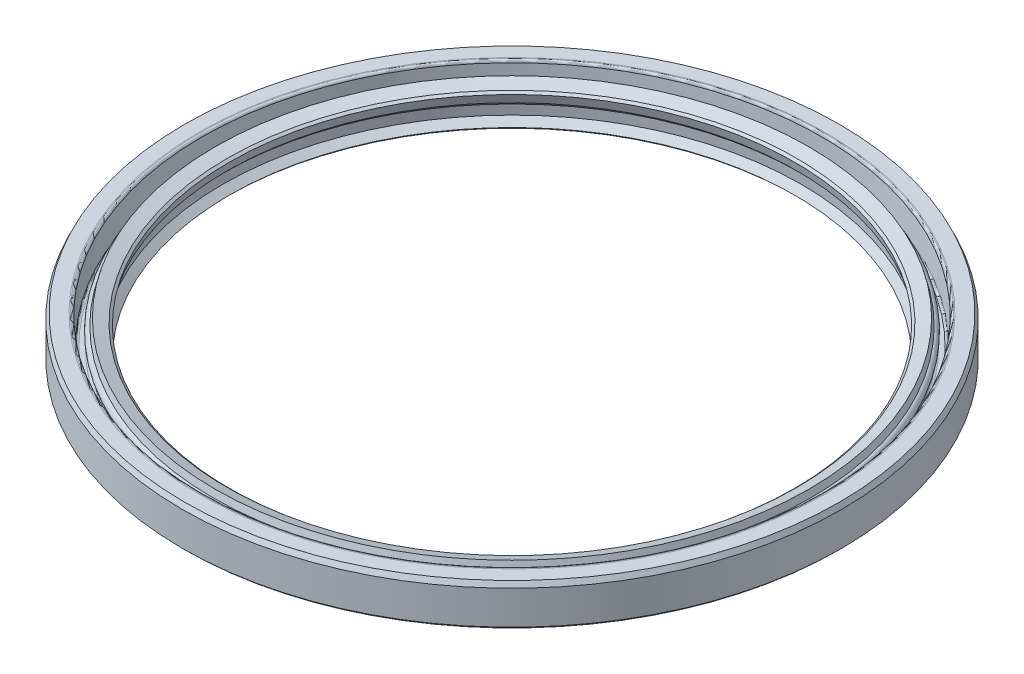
ISO-10303-21;
HEADER;
FILE_DESCRIPTION(('STEP AP214'),'2;1');
FILE_NAME('part.step','',(''),(''),'','','');
FILE_SCHEMA(('AUTOMOTIVE_DESIGN { 1 0 10303 214 1 1 1 1 }'));
ENDSEC;
DATA;
#1=APPLICATION_CONTEXT('core data for automotive mechanical design processes');
#2=APPLICATION_PROTOCOL_DEFINITION('international standard','automotive_design',2000,#1);
#3=PRODUCT_CONTEXT('',#1,'mechanical');
#4=PRODUCT('Part','Part','',(#3));
#5=PRODUCT_RELATED_PRODUCT_CATEGORY('part','',(#4));
#6=PRODUCT_DEFINITION_FORMATION('','',#4);
#7=PRODUCT_DEFINITION_CONTEXT('part definition',#1,'design');
#8=PRODUCT_DEFINITION('design','',#6,#7);
#9=PRODUCT_DEFINITION_SHAPE('','',#8);
#10=(LENGTH_UNIT() NAMED_UNIT(*) SI_UNIT(.MILLI.,.METRE.));
#11=(NAMED_UNIT(*) PLANE_ANGLE_UNIT() SI_UNIT($,.RADIAN.));
#12=(NAMED_UNIT(*) SI_UNIT($,.STERADIAN.) SOLID_ANGLE_UNIT());
#13=UNCERTAINTY_MEASURE_WITH_UNIT(LENGTH_MEASURE(1.E-05),#10,'distance_accuracy_value','');
#14=(GEOMETRIC_REPRESENTATION_CONTEXT(3) GLOBAL_UNCERTAINTY_ASSIGNED_CONTEXT((#13)) GLOBAL_UNIT_ASSIGNED_CONTEXT((#10,
#11,#12)) REPRESENTATION_CONTEXT('',''));
#15=CARTESIAN_POINT('',(0.,0.,0.));
#16=DIRECTION('',(0.,0.,1.));
#17=DIRECTION('',(1.,0.,0.));
#18=AXIS2_PLACEMENT_3D('',#15,#16,#17);
#19=CARTESIAN_POINT('',(0.,6.93347116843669,0.));
#20=DIRECTION('',(0.,-1.,0.));
#21=DIRECTION('',(0.,0.,-1.));
#22=AXIS2_PLACEMENT_3D('',#19,#20,#21);
#23=TOROIDAL_SURFACE('',#22,80.2524547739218,1.27);
#24=CARTESIAN_POINT('',(0.,6.93347116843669,80.2524547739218));
#25=DIRECTION('',(-1.,0.,0.));
#26=DIRECTION('',(0.,0.,1.));
#27=AXIS2_PLACEMENT_3D('',#24,#25,#26);
#28=CIRCLE('',#27,1.27);
#29=CARTESIAN_POINT('',(0.,6.93347116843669,78.9824547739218));
#30=VERTEX_POINT('',#29);
#31=EDGE_CURVE('P0_E28',#30,#30,#28,.T.);
#32=ORIENTED_EDGE('',*,*,#31,.F.);
#33=CARTESIAN_POINT('',(0.,6.93347116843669,0.));
#34=DIRECTION('',(0.,1.,0.));
#35=DIRECTION('',(0.,0.,-1.));
#36=AXIS2_PLACEMENT_3D('',#33,#34,#35);
#37=CIRCLE('',#36,78.9824547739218);
#38=EDGE_CURVE('P0_E11',#30,#30,#37,.T.);
#39=ORIENTED_EDGE('',*,*,#38,.T.);
#40=ORIENTED_EDGE('',*,*,#31,.T.);
#41=ORIENTED_EDGE('',*,*,#38,.F.);
#42=EDGE_LOOP('',(#32,#39,#40,#41));
#43=FACE_BOUND('',#42,.T.);
#44=ADVANCED_FACE('P0_F18',(#43),#23,.T.);
#45=CLOSED_SHELL('',(#44));
#46=CARTESIAN_POINT('',(0.,6.93347116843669,0.));
#47=DIRECTION('',(0.,-1.,0.));
#48=DIRECTION('',(0.,0.,-1.));
#49=AXIS2_PLACEMENT_3D('',#46,#47,#48);
#50=TOROIDAL_SURFACE('',#49,80.2524547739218,0.889);
#51=CARTESIAN_POINT('',(0.,6.93347116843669,0.));
#52=DIRECTION('',(0.,-1.,0.));
#53=DIRECTION('',(0.,0.,-1.));
#54=AXIS2_PLACEMENT_3D('',#51,#52,#53);
#55=CIRCLE('',#54,79.3634547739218);
#56=CARTESIAN_POINT('',(0.,6.93347116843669,79.3634547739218));
#57=VERTEX_POINT('',#56);
#58=EDGE_CURVE('P0_E47',#57,#57,#55,.T.);
#59=ORIENTED_EDGE('',*,*,#58,.F.);
#60=CARTESIAN_POINT('',(0.,6.93347116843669,80.2524547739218));
#61=DIRECTION('',(1.,0.,0.));
#62=DIRECTION('',(0.,0.,1.));
#63=AXIS2_PLACEMENT_3D('',#60,#61,#62);
#64=CIRCLE('',#63,0.889);
#65=EDGE_CURVE('P0_E46',#57,#57,#64,.T.);
#66=ORIENTED_EDGE('',*,*,#65,.T.);
#67=ORIENTED_EDGE('',*,*,#58,.T.);
#68=ORIENTED_EDGE('',*,*,#65,.F.);
#69=EDGE_LOOP('',(#59,#66,#67,#68));
#70=FACE_BOUND('',#69,.T.);
#71=ADVANCED_FACE('P0_F20',(#70),#50,.F.);
#72=CLOSED_SHELL('',(#71));
#73=ORIENTED_CLOSED_SHELL('',*,#72,.T.);
#74=BREP_WITH_VOIDS('P0_B1',#45,(#73));
#75=CARTESIAN_POINT('',(0.,10.4189190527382,0.));
#76=DIRECTION('',(0.,-1.,0.));
#77=DIRECTION('',(-1.,0.,0.));
#78=AXIS2_PLACEMENT_3D('',#75,#76,#77);
#79=CONICAL_SURFACE('',#78,88.5825,0.436332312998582);
#80=CARTESIAN_POINT('',(0.,9.73803810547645,0.));
#81=DIRECTION('',(0.,1.,0.));
#82=DIRECTION('',(-1.,0.,0.));
#83=AXIS2_PLACEMENT_3D('',#80,#81,#82);
#84=CIRCLE('',#83,88.9);
#85=CARTESIAN_POINT('',(88.9,9.73803810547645,0.));
#86=VERTEX_POINT('',#85);
#87=CARTESIAN_POINT('',(-88.9,9.73803810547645,0.));
#88=VERTEX_POINT('',#87);
#89=EDGE_CURVE('P1_E11',#86,#88,#84,.T.);
#90=ORIENTED_EDGE('',*,*,#89,.T.);
#91=CARTESIAN_POINT('',(0.,9.73803810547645,0.));
#92=DIRECTION('',(0.,1.,0.));
#93=DIRECTION('',(-1.,0.,0.));
#94=AXIS2_PLACEMENT_3D('',#91,#92,#93);
#95=CIRCLE('',#94,88.9);
#96=EDGE_CURVE('P1_E27',#88,#86,#95,.T.);
#97=ORIENTED_EDGE('',*,*,#96,.T.);
#98=DIRECTION('',(-0.422618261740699,0.90630778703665,0.));
#99=VECTOR('',#98,1.);
#100=CARTESIAN_POINT('',(88.5825,10.4189190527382,0.));
#101=LINE('',#100,#99);
#102=CARTESIAN_POINT('',(88.265,11.0998,0.));
#103=VERTEX_POINT('',#102);
#104=EDGE_CURVE('P1_E118',#86,#103,#101,.T.);
#105=ORIENTED_EDGE('',*,*,#104,.T.);
#106=CARTESIAN_POINT('',(0.,11.0998,0.));
#107=DIRECTION('',(0.,-1.,0.));
#108=DIRECTION('',(-1.,0.,0.));
#109=AXIS2_PLACEMENT_3D('',#106,#107,#108);
#110=CIRCLE('',#109,88.265);
#111=EDGE_CURVE('P1_E114',#103,#103,#110,.T.);
#112=ORIENTED_EDGE('',*,*,#111,.T.);
#113=ORIENTED_EDGE('',*,*,#104,.F.);
#114=EDGE_LOOP('',(#90,#97,#105,#112,#113));
#115=FACE_BOUND('',#114,.T.);
#116=ADVANCED_FACE('P1_F17',(#115),#79,.T.);
#117=CARTESIAN_POINT('',(0.,5.5499,0.));
#118=DIRECTION('',(0.,-1.,0.));
#119=DIRECTION('',(1.,0.,0.));
#120=AXIS2_PLACEMENT_3D('',#117,#118,#119);
#121=CYLINDRICAL_SURFACE('',#120,88.9);
#122=CARTESIAN_POINT('',(0.,0.635,0.));
#123=DIRECTION('',(0.,-1.,0.));
#124=DIRECTION('',(-1.,0.,0.));
#125=AXIS2_PLACEMENT_3D('',#122,#123,#124);
#126=CIRCLE('',#125,88.9);
#127=CARTESIAN_POINT('',(88.9,0.635,0.));
#128=VERTEX_POINT('',#127);
#129=CARTESIAN_POINT('',(-88.9,0.635,0.));
#130=VERTEX_POINT('',#129);
#131=EDGE_CURVE('P1_E86',#128,#130,#126,.T.);
#132=ORIENTED_EDGE('',*,*,#131,.F.);
#133=CARTESIAN_POINT('',(0.,0.635,0.));
#134=DIRECTION('',(0.,-1.,0.));
#135=DIRECTION('',(-1.,0.,0.));
#136=AXIS2_PLACEMENT_3D('',#133,#134,#135);
#137=CIRCLE('',#136,88.9);
#138=EDGE_CURVE('P1_E80',#130,#128,#137,.T.);
#139=ORIENTED_EDGE('',*,*,#138,.F.);
#140=DIRECTION('',(0.,1.,0.));
#141=VECTOR('',#140,1.);
#142=CARTESIAN_POINT('',(-88.9,5.5499,0.));
#143=LINE('',#142,#141);
#144=EDGE_CURVE('P1_E92',#130,#88,#143,.T.);
#145=ORIENTED_EDGE('',*,*,#144,.T.);
#146=ORIENTED_EDGE('',*,*,#89,.F.);
#147=ORIENTED_EDGE('',*,*,#96,.F.);
#148=ORIENTED_EDGE('',*,*,#144,.F.);
#149=EDGE_LOOP('',(#132,#139,#145,#146,#147,#148));
#150=FACE_BOUND('',#149,.T.);
#151=ADVANCED_FACE('P1_F91',(#150),#121,.T.);
#152=CARTESIAN_POINT('',(88.9,11.0998,0.));
#153=DIRECTION('',(0.,1.,0.));
#154=DIRECTION('',(1.,0.,0.));
#155=AXIS2_PLACEMENT_3D('',#152,#153,#154);
#156=PLANE('',#155);
#157=ORIENTED_EDGE('',*,*,#111,.F.);
#158=EDGE_LOOP('',(#157));
#159=FACE_BOUND('',#158,.T.);
#160=CARTESIAN_POINT('',(0.,11.0998,0.));
#161=DIRECTION('',(0.,-1.,0.));
#162=DIRECTION('',(1.,0.,0.));
#163=AXIS2_PLACEMENT_3D('',#160,#161,#162);
#164=CIRCLE('',#163,84.455);
#165=CARTESIAN_POINT('',(84.455,11.0998,0.));
#166=VERTEX_POINT('',#165);
#167=CARTESIAN_POINT('',(-84.455,11.0998,0.));
#168=VERTEX_POINT('',#167);
#169=EDGE_CURVE('P1_E112',#166,#168,#164,.T.);
#170=ORIENTED_EDGE('',*,*,#169,.T.);
#171=CARTESIAN_POINT('',(0.,11.0998,0.));
#172=DIRECTION('',(0.,-1.,0.));
#173=DIRECTION('',(1.,0.,0.));
#174=AXIS2_PLACEMENT_3D('',#171,#172,#173);
#175=CIRCLE('',#174,84.455);
#176=EDGE_CURVE('P1_E100',#168,#166,#175,.T.);
#177=ORIENTED_EDGE('',*,*,#176,.T.);
#178=EDGE_LOOP('',(#170,#177));
#179=FACE_BOUND('',#178,.T.);
#180=ADVANCED_FACE('P1_F134',(#159,#179),#156,.T.);
#181=CARTESIAN_POINT('',(0.,0.317500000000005,0.));
#182=DIRECTION('',(0.,1.,0.));
#183=DIRECTION('',(-1.,0.,0.));
#184=AXIS2_PLACEMENT_3D('',#181,#182,#183);
#185=CONICAL_SURFACE('',#184,88.5825,0.785398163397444);
#186=CARTESIAN_POINT('',(0.,0.,0.));
#187=DIRECTION('',(0.,1.,0.));
#188=DIRECTION('',(-1.,0.,0.));
#189=AXIS2_PLACEMENT_3D('',#186,#187,#188);
#190=CIRCLE('',#189,88.265);
#191=CARTESIAN_POINT('',(88.265,0.,0.));
#192=VERTEX_POINT('',#191);
#193=EDGE_CURVE('P1_E21',#192,#192,#190,.T.);
#194=ORIENTED_EDGE('',*,*,#193,.T.);
#195=DIRECTION('',(0.707106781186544,0.707106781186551,0.));
#196=VECTOR('',#195,1.);
#197=CARTESIAN_POINT('',(88.5825,0.317500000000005,0.));
#198=LINE('',#197,#196);
#199=EDGE_CURVE('P1_E85',#192,#128,#198,.T.);
#200=ORIENTED_EDGE('',*,*,#199,.T.);
#201=ORIENTED_EDGE('',*,*,#131,.T.);
#202=ORIENTED_EDGE('',*,*,#138,.T.);
#203=ORIENTED_EDGE('',*,*,#199,.F.);
#204=EDGE_LOOP('',(#194,#200,#201,#202,#203));
#205=FACE_BOUND('',#204,.T.);
#206=ADVANCED_FACE('P1_F83',(#205),#185,.T.);
#207=CARTESIAN_POINT('',(84.455,0.,0.));
#208=DIRECTION('',(0.,-1.,0.));
#209=DIRECTION('',(0.,0.,-1.));
#210=AXIS2_PLACEMENT_3D('',#207,#208,#209);
#211=PLANE('',#210);
#212=ORIENTED_EDGE('',*,*,#193,.F.);
#213=EDGE_LOOP('',(#212));
#214=FACE_BOUND('',#213,.T.);
#215=CARTESIAN_POINT('',(0.,0.,0.));
#216=DIRECTION('',(0.,-1.,0.));
#217=DIRECTION('',(1.,0.,0.));
#218=AXIS2_PLACEMENT_3D('',#215,#216,#217);
#219=CIRCLE('',#218,84.455);
#220=CARTESIAN_POINT('',(84.455,0.,0.));
#221=VERTEX_POINT('',#220);
#222=CARTESIAN_POINT('',(-84.455,0.,0.));
#223=VERTEX_POINT('',#222);
#224=EDGE_CURVE('P1_E89',#221,#223,#219,.T.);
#225=ORIENTED_EDGE('',*,*,#224,.F.);
#226=CARTESIAN_POINT('',(0.,0.,0.));
#227=DIRECTION('',(0.,-1.,0.));
#228=DIRECTION('',(1.,0.,0.));
#229=AXIS2_PLACEMENT_3D('',#226,#227,#228);
#230=CIRCLE('',#229,84.455);
#231=EDGE_CURVE('P1_E102',#223,#221,#230,.T.);
#232=ORIENTED_EDGE('',*,*,#231,.F.);
#233=EDGE_LOOP('',(#225,#232));
#234=FACE_BOUND('',#233,.T.);
#235=ADVANCED_FACE('P1_F140',(#214,#234),#211,.T.);
#236=CARTESIAN_POINT('',(0.,5.5499,0.));
#237=DIRECTION('',(0.,-1.,0.));
#238=DIRECTION('',(1.,0.,0.));
#239=AXIS2_PLACEMENT_3D('',#236,#237,#238);
#240=CYLINDRICAL_SURFACE('',#239,84.455);
#241=ORIENTED_EDGE('',*,*,#224,.T.);
#242=DIRECTION('',(0.,1.,0.));
#243=VECTOR('',#242,1.);
#244=CARTESIAN_POINT('',(-84.455,5.5499,0.));
#245=LINE('',#244,#243);
#246=EDGE_CURVE('P1_E106',#223,#168,#245,.T.);
#247=ORIENTED_EDGE('',*,*,#246,.T.);
#248=ORIENTED_EDGE('',*,*,#169,.F.);
#249=ORIENTED_EDGE('',*,*,#176,.F.);
#250=ORIENTED_EDGE('',*,*,#246,.F.);
#251=ORIENTED_EDGE('',*,*,#231,.T.);
#252=EDGE_LOOP('',(#241,#247,#248,#249,#250,#251));
#253=FACE_BOUND('',#252,.T.);
#254=ADVANCED_FACE('P1_F19',(#253),#240,.F.);
#255=CLOSED_SHELL('',(#116,#151,#180,#206,#235,#254));
#256=MANIFOLD_SOLID_BREP('P1_B1',#255);
#257=CARTESIAN_POINT('',(0.,0.840393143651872,0.));
#258=DIRECTION('',(0.,-1.,0.));
#259=DIRECTION('',(0.,0.,-1.));
#260=AXIS2_PLACEMENT_3D('',#257,#258,#259);
#261=TOROIDAL_SURFACE('',#260,77.9337825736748,0.127);
#262=CARTESIAN_POINT('',(0.,0.847039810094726,0.));
#263=DIRECTION('',(0.,-1.,0.));
#264=DIRECTION('',(-1.,0.,0.));
#265=AXIS2_PLACEMENT_3D('',#262,#263,#264);
#266=CIRCLE('',#265,78.0606085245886);
#267=CARTESIAN_POINT('',(78.0606085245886,0.847039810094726,0.));
#268=VERTEX_POINT('',#267);
#269=CARTESIAN_POINT('',(0.,0.847039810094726,78.0606085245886));
#270=VERTEX_POINT('',#269);
#271=EDGE_CURVE('P2_E11',#268,#270,#266,.T.);
#272=ORIENTED_EDGE('',*,*,#271,.T.);
#273=CARTESIAN_POINT('',(0.,0.840393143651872,77.9337825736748));
#274=DIRECTION('',(-1.,0.,0.));
#275=DIRECTION('',(0.,0.,1.));
#276=AXIS2_PLACEMENT_3D('',#273,#274,#275);
#277=CIRCLE('',#276,0.127);
#278=CARTESIAN_POINT('',(0.,0.93550982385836,77.8496290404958));
#279=VERTEX_POINT('',#278);
#280=EDGE_CURVE('P2_E28',#270,#279,#277,.T.);
#281=ORIENTED_EDGE('',*,*,#280,.T.);
#282=CARTESIAN_POINT('',(0.,0.93550982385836,0.));
#283=DIRECTION('',(0.,1.,0.));
#284=DIRECTION('',(-1.,0.,0.));
#285=AXIS2_PLACEMENT_3D('',#282,#283,#284);
#286=CIRCLE('',#285,77.8496290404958);
#287=CARTESIAN_POINT('',(77.8496290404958,0.93550982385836,0.));
#288=VERTEX_POINT('',#287);
#289=EDGE_CURVE('P2_E380',#279,#288,#286,.T.);
#290=ORIENTED_EDGE('',*,*,#289,.T.);
#291=CARTESIAN_POINT('',(0.,0.93550982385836,0.));
#292=DIRECTION('',(0.,1.,0.));
#293=DIRECTION('',(-1.,0.,0.));
#294=AXIS2_PLACEMENT_3D('',#291,#292,#293);
#295=CIRCLE('',#294,77.8496290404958);
#296=CARTESIAN_POINT('',(-77.8496290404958,0.935509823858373,0.));
#297=VERTEX_POINT('',#296);
#298=EDGE_CURVE('P2_E382',#288,#297,#295,.T.);
#299=ORIENTED_EDGE('',*,*,#298,.T.);
#300=CARTESIAN_POINT('',(0.,0.93550982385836,0.));
#301=DIRECTION('',(0.,1.,0.));
#302=DIRECTION('',(-1.,0.,0.));
#303=AXIS2_PLACEMENT_3D('',#300,#301,#302);
#304=CIRCLE('',#303,77.8496290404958);
#305=EDGE_CURVE('P2_E323',#297,#279,#304,.T.);
#306=ORIENTED_EDGE('',*,*,#305,.T.);
#307=ORIENTED_EDGE('',*,*,#280,.F.);
#308=CARTESIAN_POINT('',(0.,0.847039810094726,0.));
#309=DIRECTION('',(0.,-1.,0.));
#310=DIRECTION('',(-1.,0.,0.));
#311=AXIS2_PLACEMENT_3D('',#308,#309,#310);
#312=CIRCLE('',#311,78.0606085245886);
#313=CARTESIAN_POINT('',(-78.0606085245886,0.847039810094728,0.));
#314=VERTEX_POINT('',#313);
#315=EDGE_CURVE('P2_E320',#270,#314,#312,.T.);
#316=ORIENTED_EDGE('',*,*,#315,.T.);
#317=CARTESIAN_POINT('',(0.,0.847039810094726,0.));
#318=DIRECTION('',(0.,-1.,0.));
#319=DIRECTION('',(-1.,0.,0.));
#320=AXIS2_PLACEMENT_3D('',#317,#318,#319);
#321=CIRCLE('',#320,78.0606085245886);
#322=EDGE_CURVE('P2_E315',#314,#268,#321,.T.);
#323=ORIENTED_EDGE('',*,*,#322,.T.);
#324=EDGE_LOOP('',(#272,#281,#290,#299,#306,#307,#316,#323));
#325=FACE_BOUND('',#324,.T.);
#326=ADVANCED_FACE('P2_F17',(#325),#261,.F.);
#327=CARTESIAN_POINT('',(0.,2.45967298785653,0.));
#328=DIRECTION('',(0.,-1.,0.));
#329=DIRECTION('',(1.,0.,0.));
#330=AXIS2_PLACEMENT_3D('',#327,#328,#329);
#331=CONICAL_SURFACE('',#330,77.9760940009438,0.0523598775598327);
#332=CARTESIAN_POINT('',(0.,0.601766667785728,0.));
#333=DIRECTION('',(0.,1.,0.));
#334=DIRECTION('',(-1.,0.,0.));
#335=AXIS2_PLACEMENT_3D('',#332,#333,#334);
#336=CIRCLE('',#335,78.0734627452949);
#337=CARTESIAN_POINT('',(78.0734627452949,0.601766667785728,0.));
#338=VERTEX_POINT('',#337);
#339=CARTESIAN_POINT('',(-78.0734627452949,0.601766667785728,0.));
#340=VERTEX_POINT('',#339);
#341=EDGE_CURVE('P2_E289',#338,#340,#336,.T.);
#342=ORIENTED_EDGE('',*,*,#341,.F.);
#343=CARTESIAN_POINT('',(0.,0.601766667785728,0.));
#344=DIRECTION('',(0.,1.,0.));
#345=DIRECTION('',(-1.,0.,0.));
#346=AXIS2_PLACEMENT_3D('',#343,#344,#345);
#347=CIRCLE('',#346,78.0734627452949);
#348=CARTESIAN_POINT('',(0.,0.601766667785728,78.0734627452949));
#349=VERTEX_POINT('',#348);
#350=EDGE_CURVE('P2_E217',#349,#338,#347,.T.);
#351=ORIENTED_EDGE('',*,*,#350,.F.);
#352=CARTESIAN_POINT('',(0.,0.601766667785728,0.));
#353=DIRECTION('',(0.,1.,0.));
#354=DIRECTION('',(-1.,0.,0.));
#355=AXIS2_PLACEMENT_3D('',#352,#353,#354);
#356=CIRCLE('',#355,78.0734627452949);
#357=EDGE_CURVE('P2_E263',#340,#349,#356,.T.);
#358=ORIENTED_EDGE('',*,*,#357,.F.);
#359=DIRECTION('',(0.0523359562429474,0.998629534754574,0.));
#360=VECTOR('',#359,1.);
#361=CARTESIAN_POINT('',(-77.9760940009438,2.45967298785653,0.));
#362=LINE('',#361,#360);
#363=EDGE_CURVE('P2_E311',#340,#314,#362,.T.);
#364=ORIENTED_EDGE('',*,*,#363,.T.);
#365=ORIENTED_EDGE('',*,*,#315,.F.);
#366=ORIENTED_EDGE('',*,*,#271,.F.);
#367=ORIENTED_EDGE('',*,*,#322,.F.);
#368=ORIENTED_EDGE('',*,*,#363,.F.);
#369=EDGE_LOOP('',(#342,#351,#358,#364,#365,#366,#367,#368));
#370=FACE_BOUND('',#369,.T.);
#371=ADVANCED_FACE('P2_F717',(#370),#331,.F.);
#372=CARTESIAN_POINT('',(0.,0.55499,0.));
#373=DIRECTION('',(0.,1.,0.));
#374=DIRECTION('',(1.,0.,0.));
#375=AXIS2_PLACEMENT_3D('',#372,#373,#374);
#376=CONICAL_SURFACE('',#375,77.4195367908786,0.846476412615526);
#377=CARTESIAN_POINT('',(0.,0.,0.));
#378=DIRECTION('',(0.,-1.,0.));
#379=DIRECTION('',(1.,0.,0.));
#380=AXIS2_PLACEMENT_3D('',#377,#378,#379);
#381=CIRCLE('',#380,76.7922451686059);
#382=CARTESIAN_POINT('',(76.7922451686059,0.,0.));
#383=VERTEX_POINT('',#382);
#384=CARTESIAN_POINT('',(-76.7922451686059,0.,0.));
#385=VERTEX_POINT('',#384);
#386=EDGE_CURVE('P2_E267',#383,#385,#381,.T.);
#387=ORIENTED_EDGE('',*,*,#386,.F.);
#388=CARTESIAN_POINT('',(0.,0.,0.));
#389=DIRECTION('',(0.,-1.,0.));
#390=DIRECTION('',(1.,0.,0.));
#391=AXIS2_PLACEMENT_3D('',#388,#389,#390);
#392=CIRCLE('',#391,76.7922451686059);
#393=EDGE_CURVE('P2_E201',#385,#383,#392,.T.);
#394=ORIENTED_EDGE('',*,*,#393,.F.);
#395=DIRECTION('',(-0.748950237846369,0.662626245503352,0.));
#396=VECTOR('',#395,1.);
#397=CARTESIAN_POINT('',(-77.4195367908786,0.55499,0.));
#398=LINE('',#397,#396);
#399=EDGE_CURVE('P2_E293',#385,#297,#398,.T.);
#400=ORIENTED_EDGE('',*,*,#399,.T.);
#401=ORIENTED_EDGE('',*,*,#298,.F.);
#402=ORIENTED_EDGE('',*,*,#289,.F.);
#403=ORIENTED_EDGE('',*,*,#305,.F.);
#404=ORIENTED_EDGE('',*,*,#399,.F.);
#405=EDGE_LOOP('',(#387,#394,#400,#401,#402,#403,#404));
#406=FACE_BOUND('',#405,.T.);
#407=ADVANCED_FACE('P2_F429',(#406),#376,.T.);
#408=CARTESIAN_POINT('',(0.,0.635,0.));
#409=DIRECTION('',(0.,-1.,0.));
#410=DIRECTION('',(0.,0.,-1.));
#411=AXIS2_PLACEMENT_3D('',#408,#409,#410);
#412=TOROIDAL_SURFACE('',#411,78.7075924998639,0.635);
#413=ORIENTED_EDGE('',*,*,#341,.T.);
#414=ORIENTED_EDGE('',*,*,#357,.T.);
#415=CARTESIAN_POINT('',(0.,0.635,78.7075924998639));
#416=DIRECTION('',(-1.,0.,0.));
#417=DIRECTION('',(0.,0.,1.));
#418=AXIS2_PLACEMENT_3D('',#415,#416,#417);
#419=CIRCLE('',#418,0.635);
#420=CARTESIAN_POINT('',(0.,0.,78.7075924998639));
#421=VERTEX_POINT('',#420);
#422=EDGE_CURVE('P2_E259',#349,#421,#419,.T.);
#423=ORIENTED_EDGE('',*,*,#422,.T.);
#424=CARTESIAN_POINT('',(0.,0.,0.));
#425=DIRECTION('',(0.,-1.,0.));
#426=DIRECTION('',(-1.,0.,0.));
#427=AXIS2_PLACEMENT_3D('',#424,#425,#426);
#428=CIRCLE('',#427,78.7075924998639);
#429=CARTESIAN_POINT('',(78.7075924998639,0.,0.));
#430=VERTEX_POINT('',#429);
#431=EDGE_CURVE('P2_E264',#421,#430,#428,.T.);
#432=ORIENTED_EDGE('',*,*,#431,.T.);
#433=CARTESIAN_POINT('',(0.,0.,0.));
#434=DIRECTION('',(0.,-1.,0.));
#435=DIRECTION('',(-1.,0.,0.));
#436=AXIS2_PLACEMENT_3D('',#433,#434,#435);
#437=CIRCLE('',#436,78.7075924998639);
#438=EDGE_CURVE('P2_E221',#430,#421,#437,.T.);
#439=ORIENTED_EDGE('',*,*,#438,.T.);
#440=ORIENTED_EDGE('',*,*,#422,.F.);
#441=ORIENTED_EDGE('',*,*,#350,.T.);
#442=EDGE_LOOP('',(#413,#414,#423,#432,#439,#440,#441));
#443=FACE_BOUND('',#442,.T.);
#444=ADVANCED_FACE('P2_F19',(#443),#412,.T.);
#445=CARTESIAN_POINT('',(78.105,0.,0.));
#446=DIRECTION('',(0.,-1.,0.));
#447=DIRECTION('',(0.,0.,-1.));
#448=AXIS2_PLACEMENT_3D('',#445,#446,#447);
#449=PLANE('',#448);
#450=CARTESIAN_POINT('',(0.,0.,0.));
#451=DIRECTION('',(0.,-1.,0.));
#452=DIRECTION('',(1.,0.,0.));
#453=AXIS2_PLACEMENT_3D('',#450,#451,#452);
#454=CIRCLE('',#453,84.455);
#455=CARTESIAN_POINT('',(84.455,0.,0.));
#456=VERTEX_POINT('',#455);
#457=CARTESIAN_POINT('',(-84.455,0.,0.));
#458=VERTEX_POINT('',#457);
#459=EDGE_CURVE('P2_E222',#456,#458,#454,.T.);
#460=ORIENTED_EDGE('',*,*,#459,.T.);
#461=CARTESIAN_POINT('',(0.,0.,0.));
#462=DIRECTION('',(0.,-1.,0.));
#463=DIRECTION('',(1.,0.,0.));
#464=AXIS2_PLACEMENT_3D('',#461,#462,#463);
#465=CIRCLE('',#464,84.455);
#466=EDGE_CURVE('P2_E300',#458,#456,#465,.T.);
#467=ORIENTED_EDGE('',*,*,#466,.T.);
#468=EDGE_LOOP('',(#460,#467));
#469=FACE_BOUND('',#468,.T.);
#470=ORIENTED_EDGE('',*,*,#438,.F.);
#471=ORIENTED_EDGE('',*,*,#431,.F.);
#472=EDGE_LOOP('',(#470,#471));
#473=FACE_BOUND('',#472,.T.);
#474=ADVANCED_FACE('P2_F714',(#469,#473),#449,.T.);
#475=CARTESIAN_POINT('',(0.,3.96494,0.));
#476=DIRECTION('',(0.,1.,0.));
#477=DIRECTION('',(1.,0.,0.));
#478=AXIS2_PLACEMENT_3D('',#475,#476,#477);
#479=TOROIDAL_SURFACE('',#478,81.3625562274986,0.635);
#480=CARTESIAN_POINT('',(0.,3.32994,0.));
#481=DIRECTION('',(0.,1.,0.));
#482=DIRECTION('',(1.,0.,0.));
#483=AXIS2_PLACEMENT_3D('',#480,#481,#482);
#484=CIRCLE('',#483,81.3625562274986);
#485=CARTESIAN_POINT('',(-81.3625562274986,3.32994,0.));
#486=VERTEX_POINT('',#485);
#487=EDGE_CURVE('P2_E316',#486,#486,#484,.T.);
#488=ORIENTED_EDGE('',*,*,#487,.T.);
#489=CARTESIAN_POINT('',(-81.3625562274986,3.96494,0.));
#490=DIRECTION('',(0.,0.,1.));
#491=DIRECTION('',(-1.,0.,0.));
#492=AXIS2_PLACEMENT_3D('',#489,#490,#491);
#493=CIRCLE('',#492,0.635);
#494=CARTESIAN_POINT('',(-80.7373643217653,3.85376409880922,0.));
#495=VERTEX_POINT('',#494);
#496=EDGE_CURVE('P2_E227',#486,#495,#493,.T.);
#497=ORIENTED_EDGE('',*,*,#496,.T.);
#498=CARTESIAN_POINT('',(0.,3.85376409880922,0.));
#499=DIRECTION('',(0.,-1.,0.));
#500=DIRECTION('',(1.,0.,0.));
#501=AXIS2_PLACEMENT_3D('',#498,#499,#500);
#502=CIRCLE('',#501,80.7373643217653);
#503=EDGE_CURVE('P2_E223',#495,#495,#502,.T.);
#504=ORIENTED_EDGE('',*,*,#503,.T.);
#505=ORIENTED_EDGE('',*,*,#496,.F.);
#506=EDGE_LOOP('',(#488,#497,#504,#505));
#507=FACE_BOUND('',#506,.T.);
#508=ADVANCED_FACE('P2_F737',(#507),#479,.F.);
#509=CARTESIAN_POINT('',(83.185,3.32994,0.));
#510=DIRECTION('',(0.,1.,0.));
#511=DIRECTION('',(1.,0.,0.));
#512=AXIS2_PLACEMENT_3D('',#509,#510,#511);
#513=PLANE('',#512);
#514=CARTESIAN_POINT('',(0.,3.32994,0.));
#515=DIRECTION('',(0.,-1.,0.));
#516=DIRECTION('',(-1.,0.,0.));
#517=AXIS2_PLACEMENT_3D('',#514,#515,#516);
#518=CIRCLE('',#517,82.5824075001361);
#519=CARTESIAN_POINT('',(82.5824075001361,3.32994,0.));
#520=VERTEX_POINT('',#519);
#521=CARTESIAN_POINT('',(0.,3.32994,82.5824075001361));
#522=VERTEX_POINT('',#521);
#523=EDGE_CURVE('P2_E228',#520,#522,#518,.T.);
#524=ORIENTED_EDGE('',*,*,#523,.F.);
#525=CARTESIAN_POINT('',(0.,3.32994,0.));
#526=DIRECTION('',(0.,-1.,0.));
#527=DIRECTION('',(-1.,0.,0.));
#528=AXIS2_PLACEMENT_3D('',#525,#526,#527);
#529=CIRCLE('',#528,82.5824075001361);
#530=EDGE_CURVE('P2_E281',#522,#520,#529,.T.);
#531=ORIENTED_EDGE('',*,*,#530,.F.);
#532=EDGE_LOOP('',(#524,#531));
#533=FACE_BOUND('',#532,.T.);
#534=ORIENTED_EDGE('',*,*,#487,.F.);
#535=EDGE_LOOP('',(#534));
#536=FACE_BOUND('',#535,.T.);
#537=ADVANCED_FACE('P2_F734',(#533,#536),#513,.T.);
#538=CARTESIAN_POINT('',(0.,3.96494,0.));
#539=DIRECTION('',(0.,-1.,0.));
#540=DIRECTION('',(0.,0.,-1.));
#541=AXIS2_PLACEMENT_3D('',#538,#539,#540);
#542=TOROIDAL_SURFACE('',#541,82.5824075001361,0.635);
#543=ORIENTED_EDGE('',*,*,#523,.T.);
#544=CARTESIAN_POINT('',(0.,3.96494,82.5824075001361));
#545=DIRECTION('',(-1.,0.,0.));
#546=DIRECTION('',(0.,0.,1.));
#547=AXIS2_PLACEMENT_3D('',#544,#545,#546);
#548=CIRCLE('',#547,0.635);
#549=CARTESIAN_POINT('',(0.,3.93170666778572,83.2165372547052));
#550=VERTEX_POINT('',#549);
#551=EDGE_CURVE('P2_E367',#522,#550,#548,.T.);
#552=ORIENTED_EDGE('',*,*,#551,.T.);
#553=CARTESIAN_POINT('',(0.,3.93170666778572,0.));
#554=DIRECTION('',(0.,1.,0.));
#555=DIRECTION('',(-1.,0.,0.));
#556=AXIS2_PLACEMENT_3D('',#553,#554,#555);
#557=CIRCLE('',#556,83.2165372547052);
#558=CARTESIAN_POINT('',(83.2165372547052,3.93170666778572,0.));
#559=VERTEX_POINT('',#558);
#560=EDGE_CURVE('P2_E364',#550,#559,#557,.T.);
#561=ORIENTED_EDGE('',*,*,#560,.T.);
#562=CARTESIAN_POINT('',(0.,3.93170666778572,0.));
#563=DIRECTION('',(0.,1.,0.));
#564=DIRECTION('',(-1.,0.,0.));
#565=AXIS2_PLACEMENT_3D('',#562,#563,#564);
#566=CIRCLE('',#565,83.2165372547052);
#567=CARTESIAN_POINT('',(-83.2165372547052,3.93170666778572,0.));
#568=VERTEX_POINT('',#567);
#569=EDGE_CURVE('P2_E341',#559,#568,#566,.T.);
#570=ORIENTED_EDGE('',*,*,#569,.T.);
#571=CARTESIAN_POINT('',(0.,3.93170666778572,0.));
#572=DIRECTION('',(0.,1.,0.));
#573=DIRECTION('',(-1.,0.,0.));
#574=AXIS2_PLACEMENT_3D('',#571,#572,#573);
#575=CIRCLE('',#574,83.2165372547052);
#576=EDGE_CURVE('P2_E337',#568,#550,#575,.T.);
#577=ORIENTED_EDGE('',*,*,#576,.T.);
#578=ORIENTED_EDGE('',*,*,#551,.F.);
#579=ORIENTED_EDGE('',*,*,#530,.T.);
#580=EDGE_LOOP('',(#543,#552,#561,#570,#577,#578,#579));
#581=FACE_BOUND('',#580,.T.);
#582=ADVANCED_FACE('P2_F479',(#581),#542,.F.);
#583=CARTESIAN_POINT('',(0.,7.21487,0.));
#584=DIRECTION('',(0.,1.,0.));
#585=DIRECTION('',(1.,0.,0.));
#586=AXIS2_PLACEMENT_3D('',#583,#584,#585);
#587=CONICAL_SURFACE('',#586,83.38860055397,0.0523598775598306);
#588=ORIENTED_EDGE('',*,*,#569,.F.);
#589=ORIENTED_EDGE('',*,*,#560,.F.);
#590=ORIENTED_EDGE('',*,*,#576,.F.);
#591=DIRECTION('',(-0.0523359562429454,0.998629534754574,0.));
#592=VECTOR('',#591,1.);
#593=CARTESIAN_POINT('',(-83.38860055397,7.21487,0.));
#594=LINE('',#593,#592);
#595=CARTESIAN_POINT('',(-83.5606638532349,10.4980333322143,0.));
#596=VERTEX_POINT('',#595);
#597=EDGE_CURVE('P2_E277',#568,#596,#594,.T.);
#598=ORIENTED_EDGE('',*,*,#597,.T.);
#599=CARTESIAN_POINT('',(0.,10.4980333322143,0.));
#600=DIRECTION('',(0.,-1.,0.));
#601=DIRECTION('',(-1.,0.,0.));
#602=AXIS2_PLACEMENT_3D('',#599,#600,#601);
#603=CIRCLE('',#602,83.5606638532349);
#604=CARTESIAN_POINT('',(0.,10.4980333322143,83.5606638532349));
#605=VERTEX_POINT('',#604);
#606=EDGE_CURVE('P2_E352',#605,#596,#603,.T.);
#607=ORIENTED_EDGE('',*,*,#606,.F.);
#608=CARTESIAN_POINT('',(0.,10.4980333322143,0.));
#609=DIRECTION('',(0.,-1.,0.));
#610=DIRECTION('',(-1.,0.,0.));
#611=AXIS2_PLACEMENT_3D('',#608,#609,#610);
#612=CIRCLE('',#611,83.5606638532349);
#613=CARTESIAN_POINT('',(83.5606638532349,10.4980333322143,0.));
#614=VERTEX_POINT('',#613);
#615=EDGE_CURVE('P2_E353',#614,#605,#612,.T.);
#616=ORIENTED_EDGE('',*,*,#615,.F.);
#617=CARTESIAN_POINT('',(0.,10.4980333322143,0.));
#618=DIRECTION('',(0.,-1.,0.));
#619=DIRECTION('',(-1.,0.,0.));
#620=AXIS2_PLACEMENT_3D('',#617,#618,#619);
#621=CIRCLE('',#620,83.5606638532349);
#622=EDGE_CURVE('P2_E348',#596,#614,#621,.T.);
#623=ORIENTED_EDGE('',*,*,#622,.F.);
#624=ORIENTED_EDGE('',*,*,#597,.F.);
#625=EDGE_LOOP('',(#588,#589,#590,#598,#607,#616,#623,#624));
#626=FACE_BOUND('',#625,.T.);
#627=ADVANCED_FACE('P2_F474',(#626),#587,.F.);
#628=CARTESIAN_POINT('',(0.,10.4648,0.));
#629=DIRECTION('',(0.,-1.,0.));
#630=DIRECTION('',(0.,0.,-1.));
#631=AXIS2_PLACEMENT_3D('',#628,#629,#630);
#632=TOROIDAL_SURFACE('',#631,84.194793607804,0.635);
#633=CARTESIAN_POINT('',(0.,11.0998,0.));
#634=DIRECTION('',(0.,1.,0.));
#635=DIRECTION('',(-1.,0.,0.));
#636=AXIS2_PLACEMENT_3D('',#633,#634,#635);
#637=CIRCLE('',#636,84.194793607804);
#638=CARTESIAN_POINT('',(84.194793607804,11.0998,0.));
#639=VERTEX_POINT('',#638);
#640=CARTESIAN_POINT('',(0.,11.0998,84.194793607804));
#641=VERTEX_POINT('',#640);
#642=EDGE_CURVE('P2_E282',#639,#641,#637,.T.);
#643=ORIENTED_EDGE('',*,*,#642,.T.);
#644=CARTESIAN_POINT('',(0.,10.4648,84.194793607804));
#645=DIRECTION('',(-1.,0.,0.));
#646=DIRECTION('',(0.,0.,1.));
#647=AXIS2_PLACEMENT_3D('',#644,#645,#646);
#648=CIRCLE('',#647,0.635);
#649=EDGE_CURVE('P2_E21',#641,#605,#648,.T.);
#650=ORIENTED_EDGE('',*,*,#649,.T.);
#651=ORIENTED_EDGE('',*,*,#606,.T.);
#652=ORIENTED_EDGE('',*,*,#622,.T.);
#653=ORIENTED_EDGE('',*,*,#615,.T.);
#654=ORIENTED_EDGE('',*,*,#649,.F.);
#655=CARTESIAN_POINT('',(0.,11.0998,0.));
#656=DIRECTION('',(0.,1.,0.));
#657=DIRECTION('',(-1.,0.,0.));
#658=AXIS2_PLACEMENT_3D('',#655,#656,#657);
#659=CIRCLE('',#658,84.194793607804);
#660=EDGE_CURVE('P2_E233',#641,#639,#659,.T.);
#661=ORIENTED_EDGE('',*,*,#660,.T.);
#662=EDGE_LOOP('',(#643,#650,#651,#652,#653,#654,#661));
#663=FACE_BOUND('',#662,.T.);
#664=ADVANCED_FACE('P2_F489',(#663),#632,.T.);
#665=CARTESIAN_POINT('',(84.455,11.0998,0.));
#666=DIRECTION('',(0.,1.,0.));
#667=DIRECTION('',(1.,0.,0.));
#668=AXIS2_PLACEMENT_3D('',#665,#666,#667);
#669=PLANE('',#668);
#670=CARTESIAN_POINT('',(0.,11.0998,0.));
#671=DIRECTION('',(0.,-1.,0.));
#672=DIRECTION('',(1.,0.,0.));
#673=AXIS2_PLACEMENT_3D('',#670,#671,#672);
#674=CIRCLE('',#673,84.455);
#675=CARTESIAN_POINT('',(84.455,11.0998,0.));
#676=VERTEX_POINT('',#675);
#677=CARTESIAN_POINT('',(-84.455,11.0998,0.));
#678=VERTEX_POINT('',#677);
#679=EDGE_CURVE('P2_E246',#676,#678,#674,.T.);
#680=ORIENTED_EDGE('',*,*,#679,.F.);
#681=CARTESIAN_POINT('',(0.,11.0998,0.));
#682=DIRECTION('',(0.,-1.,0.));
#683=DIRECTION('',(1.,0.,0.));
#684=AXIS2_PLACEMENT_3D('',#681,#682,#683);
#685=CIRCLE('',#684,84.455);
#686=EDGE_CURVE('P2_E241',#678,#676,#685,.T.);
#687=ORIENTED_EDGE('',*,*,#686,.F.);
#688=EDGE_LOOP('',(#680,#687));
#689=FACE_BOUND('',#688,.T.);
#690=ORIENTED_EDGE('',*,*,#642,.F.);
#691=ORIENTED_EDGE('',*,*,#660,.F.);
#692=EDGE_LOOP('',(#690,#691));
#693=FACE_BOUND('',#692,.T.);
#694=ADVANCED_FACE('P2_F754',(#689,#693),#669,.T.);
#695=CARTESIAN_POINT('',(0.,2.45967298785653,0.));
#696=DIRECTION('',(0.,-1.,0.));
#697=DIRECTION('',(1.,0.,0.));
#698=AXIS2_PLACEMENT_3D('',#695,#696,#697);
#699=CONICAL_SURFACE('',#698,77.9760940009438,0.0523598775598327);
#700=CARTESIAN_POINT('',(0.,2.21996,0.));
#701=DIRECTION('',(0.,-1.,0.));
#702=DIRECTION('',(1.,0.,0.));
#703=AXIS2_PLACEMENT_3D('',#700,#701,#702);
#704=CIRCLE('',#703,77.9886568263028);
#705=CARTESIAN_POINT('',(77.9886568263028,2.21996,0.));
#706=VERTEX_POINT('',#705);
#707=CARTESIAN_POINT('',(-77.9886568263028,2.21996,0.));
#708=VERTEX_POINT('',#707);
#709=EDGE_CURVE('P2_E229',#706,#708,#704,.T.);
#710=ORIENTED_EDGE('',*,*,#709,.T.);
#711=DIRECTION('',(0.0523359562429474,0.998629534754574,0.));
#712=VECTOR('',#711,1.);
#713=CARTESIAN_POINT('',(-77.9760940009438,2.45967298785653,0.));
#714=LINE('',#713,#712);
#715=CARTESIAN_POINT('',(-77.8471880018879,4.91934597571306,0.));
#716=VERTEX_POINT('',#715);
#717=EDGE_CURVE('P2_E234',#708,#716,#714,.T.);
#718=ORIENTED_EDGE('',*,*,#717,.T.);
#719=CARTESIAN_POINT('',(0.,4.91934597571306,0.));
#720=DIRECTION('',(0.,-1.,0.));
#721=DIRECTION('',(1.,0.,0.));
#722=AXIS2_PLACEMENT_3D('',#719,#720,#721);
#723=CIRCLE('',#722,77.8471880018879);
#724=CARTESIAN_POINT('',(77.8471880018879,4.91934597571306,0.));
#725=VERTEX_POINT('',#724);
#726=EDGE_CURVE('P2_E255',#725,#716,#723,.T.);
#727=ORIENTED_EDGE('',*,*,#726,.F.);
#728=CARTESIAN_POINT('',(0.,4.91934597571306,0.));
#729=DIRECTION('',(0.,-1.,0.));
#730=DIRECTION('',(1.,0.,0.));
#731=AXIS2_PLACEMENT_3D('',#728,#729,#730);
#732=CIRCLE('',#731,77.8471880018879);
#733=EDGE_CURVE('P2_E392',#716,#725,#732,.T.);
#734=ORIENTED_EDGE('',*,*,#733,.F.);
#735=ORIENTED_EDGE('',*,*,#717,.F.);
#736=CARTESIAN_POINT('',(0.,2.21996,0.));
#737=DIRECTION('',(0.,-1.,0.));
#738=DIRECTION('',(1.,0.,0.));
#739=AXIS2_PLACEMENT_3D('',#736,#737,#738);
#740=CIRCLE('',#739,77.9886568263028);
#741=EDGE_CURVE('P2_E239',#708,#706,#740,.T.);
#742=ORIENTED_EDGE('',*,*,#741,.T.);
#743=EDGE_LOOP('',(#710,#718,#727,#734,#735,#742));
#744=FACE_BOUND('',#743,.T.);
#745=ADVANCED_FACE('P2_F757',(#744),#699,.F.);
#746=CARTESIAN_POINT('',(0.,9.41201725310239,0.));
#747=DIRECTION('',(0.,1.,0.));
#748=DIRECTION('',(1.,0.,0.));
#749=AXIS2_PLACEMENT_3D('',#746,#747,#748);
#750=CONICAL_SURFACE('',#749,78.4225,1.22173047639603);
#751=CARTESIAN_POINT('',(0.,8.83421450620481,0.));
#752=DIRECTION('',(0.,-1.,0.));
#753=DIRECTION('',(1.,0.,0.));
#754=AXIS2_PLACEMENT_3D('',#751,#752,#753);
#755=CIRCLE('',#754,76.835);
#756=CARTESIAN_POINT('',(76.835,8.83421450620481,0.));
#757=VERTEX_POINT('',#756);
#758=CARTESIAN_POINT('',(-76.835,8.83421450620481,0.));
#759=VERTEX_POINT('',#758);
#760=EDGE_CURVE('P2_E235',#757,#759,#755,.T.);
#761=ORIENTED_EDGE('',*,*,#760,.T.);
#762=DIRECTION('',(-0.939692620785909,0.342020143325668,0.));
#763=VECTOR('',#762,1.);
#764=CARTESIAN_POINT('',(-78.4225,9.41201725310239,0.));
#765=LINE('',#764,#763);
#766=CARTESIAN_POINT('',(-80.01,9.98982,0.));
#767=VERTEX_POINT('',#766);
#768=EDGE_CURVE('P2_E240',#759,#767,#765,.T.);
#769=ORIENTED_EDGE('',*,*,#768,.T.);
#770=CARTESIAN_POINT('',(0.,9.98982,0.));
#771=DIRECTION('',(0.,-1.,0.));
#772=DIRECTION('',(1.,0.,0.));
#773=AXIS2_PLACEMENT_3D('',#770,#771,#772);
#774=CIRCLE('',#773,80.01);
#775=CARTESIAN_POINT('',(80.01,9.98982,0.));
#776=VERTEX_POINT('',#775);
#777=EDGE_CURVE('P2_E358',#776,#767,#774,.T.);
#778=ORIENTED_EDGE('',*,*,#777,.F.);
#779=CARTESIAN_POINT('',(0.,9.98982,0.));
#780=DIRECTION('',(0.,-1.,0.));
#781=DIRECTION('',(1.,0.,0.));
#782=AXIS2_PLACEMENT_3D('',#779,#780,#781);
#783=CIRCLE('',#782,80.01);
#784=EDGE_CURVE('P2_E360',#767,#776,#783,.T.);
#785=ORIENTED_EDGE('',*,*,#784,.F.);
#786=ORIENTED_EDGE('',*,*,#768,.F.);
#787=CARTESIAN_POINT('',(0.,8.83421450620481,0.));
#788=DIRECTION('',(0.,-1.,0.));
#789=DIRECTION('',(1.,0.,0.));
#790=AXIS2_PLACEMENT_3D('',#787,#788,#789);
#791=CIRCLE('',#790,76.835);
#792=EDGE_CURVE('P2_E327',#759,#757,#791,.T.);
#793=ORIENTED_EDGE('',*,*,#792,.T.);
#794=EDGE_LOOP('',(#761,#769,#778,#785,#786,#793));
#795=FACE_BOUND('',#794,.T.);
#796=ADVANCED_FACE('P2_F763',(#795),#750,.F.);
#797=CARTESIAN_POINT('',(0.,9.08496646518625,0.));
#798=DIRECTION('',(0.,-1.,0.));
#799=DIRECTION('',(1.,0.,0.));
#800=AXIS2_PLACEMENT_3D('',#797,#798,#799);
#801=CONICAL_SURFACE('',#800,80.2524547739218,0.261799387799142);
#802=CARTESIAN_POINT('',(0.,8.18011293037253,0.));
#803=DIRECTION('',(0.,-1.,0.));
#804=DIRECTION('',(1.,0.,0.));
#805=AXIS2_PLACEMENT_3D('',#802,#803,#804);
#806=CIRCLE('',#805,80.4949095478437);
#807=CARTESIAN_POINT('',(80.4949095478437,8.18011293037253,0.));
#808=VERTEX_POINT('',#807);
#809=CARTESIAN_POINT('',(0.,8.18011293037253,80.4949095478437));
#810=VERTEX_POINT('',#809);
#811=EDGE_CURVE('P2_E305',#808,#810,#806,.T.);
#812=ORIENTED_EDGE('',*,*,#811,.F.);
#813=CARTESIAN_POINT('',(0.,8.18011293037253,0.));
#814=DIRECTION('',(0.,-1.,0.));
#815=DIRECTION('',(1.,0.,0.));
#816=AXIS2_PLACEMENT_3D('',#813,#814,#815);
#817=CIRCLE('',#816,80.4949095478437);
#818=CARTESIAN_POINT('',(-80.4949095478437,8.18011293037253,0.));
#819=VERTEX_POINT('',#818);
#820=EDGE_CURVE('P2_E310',#819,#808,#817,.T.);
#821=ORIENTED_EDGE('',*,*,#820,.F.);
#822=DIRECTION('',(0.258819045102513,0.96592582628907,0.));
#823=VECTOR('',#822,1.);
#824=CARTESIAN_POINT('',(-80.2524547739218,9.08496646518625,0.));
#825=LINE('',#824,#823);
#826=EDGE_CURVE('P2_E331',#819,#767,#825,.T.);
#827=ORIENTED_EDGE('',*,*,#826,.T.);
#828=ORIENTED_EDGE('',*,*,#784,.T.);
#829=ORIENTED_EDGE('',*,*,#777,.T.);
#830=ORIENTED_EDGE('',*,*,#826,.F.);
#831=CARTESIAN_POINT('',(0.,8.18011293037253,0.));
#832=DIRECTION('',(0.,-1.,0.));
#833=DIRECTION('',(1.,0.,0.));
#834=AXIS2_PLACEMENT_3D('',#831,#832,#833);
#835=CIRCLE('',#834,80.4949095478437);
#836=EDGE_CURVE('P2_E306',#810,#819,#835,.T.);
#837=ORIENTED_EDGE('',*,*,#836,.F.);
#838=EDGE_LOOP('',(#812,#821,#827,#828,#829,#830,#837));
#839=FACE_BOUND('',#838,.T.);
#840=ADVANCED_FACE('P2_F730',(#839),#801,.T.);
#841=CARTESIAN_POINT('',(0.,6.93347116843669,0.));
#842=DIRECTION('',(0.,-1.,0.));
#843=DIRECTION('',(0.,0.,-1.));
#844=AXIS2_PLACEMENT_3D('',#841,#842,#843);
#845=TOROIDAL_SURFACE('',#844,80.2524547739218,1.27);
#846=ORIENTED_EDGE('',*,*,#811,.T.);
#847=CARTESIAN_POINT('',(0.,6.93347116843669,80.2524547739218));
#848=DIRECTION('',(-1.,0.,0.));
#849=DIRECTION('',(0.,0.,1.));
#850=AXIS2_PLACEMENT_3D('',#847,#848,#849);
#851=CIRCLE('',#850,1.27);
#852=CARTESIAN_POINT('',(0.,5.66347116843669,80.2524547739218));
#853=VERTEX_POINT('',#852);
#854=EDGE_CURVE('P2_E301',#810,#853,#851,.T.);
#855=ORIENTED_EDGE('',*,*,#854,.T.);
#856=CARTESIAN_POINT('',(0.,5.66347116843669,0.));
#857=DIRECTION('',(0.,-1.,0.));
#858=DIRECTION('',(1.,0.,0.));
#859=AXIS2_PLACEMENT_3D('',#856,#857,#858);
#860=CIRCLE('',#859,80.2524547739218);
#861=CARTESIAN_POINT('',(80.2524547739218,5.66347116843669,0.));
#862=VERTEX_POINT('',#861);
#863=EDGE_CURVE('P2_E288',#862,#853,#860,.T.);
#864=ORIENTED_EDGE('',*,*,#863,.F.);
#865=CARTESIAN_POINT('',(0.,5.66347116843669,0.));
#866=DIRECTION('',(0.,-1.,0.));
#867=DIRECTION('',(1.,0.,0.));
#868=AXIS2_PLACEMENT_3D('',#865,#866,#867);
#869=CIRCLE('',#868,80.2524547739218);
#870=CARTESIAN_POINT('',(-80.2524547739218,5.66347116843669,0.));
#871=VERTEX_POINT('',#870);
#872=EDGE_CURVE('P2_E283',#871,#862,#869,.T.);
#873=ORIENTED_EDGE('',*,*,#872,.F.);
#874=CARTESIAN_POINT('',(0.,5.66347116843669,0.));
#875=DIRECTION('',(0.,-1.,0.));
#876=DIRECTION('',(1.,0.,0.));
#877=AXIS2_PLACEMENT_3D('',#874,#875,#876);
#878=CIRCLE('',#877,80.2524547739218);
#879=EDGE_CURVE('P2_E215',#853,#871,#878,.T.);
#880=ORIENTED_EDGE('',*,*,#879,.F.);
#881=ORIENTED_EDGE('',*,*,#854,.F.);
#882=ORIENTED_EDGE('',*,*,#836,.T.);
#883=ORIENTED_EDGE('',*,*,#820,.T.);
#884=EDGE_LOOP('',(#846,#855,#864,#873,#880,#881,#882,#883));
#885=FACE_BOUND('',#884,.T.);
#886=ADVANCED_FACE('P2_F787',(#885),#845,.F.);
#887=CARTESIAN_POINT('',(0.,4.75861763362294,0.));
#888=DIRECTION('',(0.,-1.,0.));
#889=DIRECTION('',(1.,0.,0.));
#890=AXIS2_PLACEMENT_3D('',#887,#888,#889);
#891=CONICAL_SURFACE('',#890,80.4949095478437,0.26179938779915);
#892=ORIENTED_EDGE('',*,*,#503,.F.);
#893=DIRECTION('',(0.258819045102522,0.965925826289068,0.));
#894=VECTOR('',#893,1.);
#895=CARTESIAN_POINT('',(-80.4949095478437,4.75861763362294,0.));
#896=LINE('',#895,#894);
#897=EDGE_CURVE('P2_E287',#495,#871,#896,.T.);
#898=ORIENTED_EDGE('',*,*,#897,.T.);
#899=ORIENTED_EDGE('',*,*,#872,.T.);
#900=ORIENTED_EDGE('',*,*,#863,.T.);
#901=ORIENTED_EDGE('',*,*,#879,.T.);
#902=ORIENTED_EDGE('',*,*,#897,.F.);
#903=EDGE_LOOP('',(#892,#898,#899,#900,#901,#902));
#904=FACE_BOUND('',#903,.T.);
#905=ADVANCED_FACE('P2_F776',(#904),#891,.T.);
#906=CARTESIAN_POINT('',(0.,5.5499,0.));
#907=DIRECTION('',(0.,-1.,0.));
#908=DIRECTION('',(1.,0.,0.));
#909=AXIS2_PLACEMENT_3D('',#906,#907,#908);
#910=CYLINDRICAL_SURFACE('',#909,84.455);
#911=ORIENTED_EDGE('',*,*,#459,.F.);
#912=ORIENTED_EDGE('',*,*,#466,.F.);
#913=DIRECTION('',(0.,1.,0.));
#914=VECTOR('',#913,1.);
#915=CARTESIAN_POINT('',(-84.455,5.5499,0.));
#916=LINE('',#915,#914);
#917=EDGE_CURVE('P2_E245',#458,#678,#916,.T.);
#918=ORIENTED_EDGE('',*,*,#917,.T.);
#919=ORIENTED_EDGE('',*,*,#686,.T.);
#920=ORIENTED_EDGE('',*,*,#679,.T.);
#921=ORIENTED_EDGE('',*,*,#917,.F.);
#922=EDGE_LOOP('',(#911,#912,#918,#919,#920,#921));
#923=FACE_BOUND('',#922,.T.);
#924=ADVANCED_FACE('P2_F751',(#923),#910,.T.);
#925=CARTESIAN_POINT('',(0.,5.42543997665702,0.));
#926=DIRECTION('',(0.,-1.,0.));
#927=DIRECTION('',(1.,0.,0.));
#928=AXIS2_PLACEMENT_3D('',#925,#926,#927);
#929=CONICAL_SURFACE('',#928,77.3410940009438,0.78539816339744);
#930=ORIENTED_EDGE('',*,*,#726,.T.);
#931=DIRECTION('',(0.707106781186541,0.707106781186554,0.));
#932=VECTOR('',#931,1.);
#933=CARTESIAN_POINT('',(-77.3410940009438,5.42543997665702,0.));
#934=LINE('',#933,#932);
#935=CARTESIAN_POINT('',(-76.835,5.93153397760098,0.));
#936=VERTEX_POINT('',#935);
#937=EDGE_CURVE('P2_E357',#716,#936,#934,.T.);
#938=ORIENTED_EDGE('',*,*,#937,.T.);
#939=CARTESIAN_POINT('',(0.,5.93153397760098,0.));
#940=DIRECTION('',(0.,-1.,0.));
#941=DIRECTION('',(1.,0.,0.));
#942=AXIS2_PLACEMENT_3D('',#939,#940,#941);
#943=CIRCLE('',#942,76.835);
#944=CARTESIAN_POINT('',(76.835,5.93153397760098,0.));
#945=VERTEX_POINT('',#944);
#946=EDGE_CURVE('P2_E275',#945,#936,#943,.T.);
#947=ORIENTED_EDGE('',*,*,#946,.F.);
#948=CARTESIAN_POINT('',(0.,5.93153397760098,0.));
#949=DIRECTION('',(0.,-1.,0.));
#950=DIRECTION('',(1.,0.,0.));
#951=AXIS2_PLACEMENT_3D('',#948,#949,#950);
#952=CIRCLE('',#951,76.835);
#953=EDGE_CURVE('P2_E276',#936,#945,#952,.T.);
#954=ORIENTED_EDGE('',*,*,#953,.F.);
#955=ORIENTED_EDGE('',*,*,#937,.F.);
#956=ORIENTED_EDGE('',*,*,#733,.T.);
#957=EDGE_LOOP('',(#930,#938,#947,#954,#955,#956));
#958=FACE_BOUND('',#957,.T.);
#959=ADVANCED_FACE('P2_F775',(#958),#929,.F.);
#960=CARTESIAN_POINT('',(0.,7.1164601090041,0.));
#961=DIRECTION('',(0.,-1.,0.));
#962=DIRECTION('',(1.,0.,0.));
#963=AXIS2_PLACEMENT_3D('',#960,#961,#962);
#964=CONICAL_SURFACE('',#963,76.5175,0.261799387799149);
#965=ORIENTED_EDGE('',*,*,#946,.T.);
#966=DIRECTION('',(0.25881904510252,0.965925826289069,0.));
#967=VECTOR('',#966,1.);
#968=CARTESIAN_POINT('',(-76.5175,7.1164601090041,0.));
#969=LINE('',#968,#967);
#970=CARTESIAN_POINT('',(-76.2,8.30138624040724,0.));
#971=VERTEX_POINT('',#970);
#972=EDGE_CURVE('P2_E271',#936,#971,#969,.T.);
#973=ORIENTED_EDGE('',*,*,#972,.T.);
#974=CARTESIAN_POINT('',(0.,8.30138624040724,0.));
#975=DIRECTION('',(0.,-1.,0.));
#976=DIRECTION('',(1.,0.,0.));
#977=AXIS2_PLACEMENT_3D('',#974,#975,#976);
#978=CIRCLE('',#977,76.2);
#979=CARTESIAN_POINT('',(76.2,8.30138624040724,0.));
#980=VERTEX_POINT('',#979);
#981=EDGE_CURVE('P2_E251',#980,#971,#978,.T.);
#982=ORIENTED_EDGE('',*,*,#981,.F.);
#983=CARTESIAN_POINT('',(0.,8.30138624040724,0.));
#984=DIRECTION('',(0.,-1.,0.));
#985=DIRECTION('',(1.,0.,0.));
#986=AXIS2_PLACEMENT_3D('',#983,#984,#985);
#987=CIRCLE('',#986,76.2);
#988=EDGE_CURVE('P2_E252',#971,#980,#987,.T.);
#989=ORIENTED_EDGE('',*,*,#988,.F.);
#990=ORIENTED_EDGE('',*,*,#972,.F.);
#991=ORIENTED_EDGE('',*,*,#953,.T.);
#992=EDGE_LOOP('',(#965,#973,#982,#989,#990,#991));
#993=FACE_BOUND('',#992,.T.);
#994=ADVANCED_FACE('P2_F778',(#993),#964,.F.);
#995=CARTESIAN_POINT('',(0.,8.56780037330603,0.));
#996=DIRECTION('',(0.,1.,0.));
#997=DIRECTION('',(1.,0.,0.));
#998=AXIS2_PLACEMENT_3D('',#995,#996,#997);
#999=CONICAL_SURFACE('',#998,76.5175,0.872664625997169);
#1000=ORIENTED_EDGE('',*,*,#981,.T.);
#1001=DIRECTION('',(-0.766044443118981,0.642787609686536,0.));
#1002=VECTOR('',#1001,1.);
#1003=CARTESIAN_POINT('',(-76.5175,8.56780037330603,0.));
#1004=LINE('',#1003,#1002);
#1005=EDGE_CURVE('P2_E247',#971,#759,#1004,.T.);
#1006=ORIENTED_EDGE('',*,*,#1005,.T.);
#1007=ORIENTED_EDGE('',*,*,#760,.F.);
#1008=ORIENTED_EDGE('',*,*,#792,.F.);
#1009=ORIENTED_EDGE('',*,*,#1005,.F.);
#1010=ORIENTED_EDGE('',*,*,#988,.T.);
#1011=EDGE_LOOP('',(#1000,#1006,#1007,#1008,#1009,#1010));
#1012=FACE_BOUND('',#1011,.T.);
#1013=ADVANCED_FACE('P2_F741',(#1012),#999,.F.);
#1014=CARTESIAN_POINT('',(0.,0.296122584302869,0.));
#1015=DIRECTION('',(0.,-1.,0.));
#1016=DIRECTION('',(1.,0.,0.));
#1017=AXIS2_PLACEMENT_3D('',#1014,#1015,#1016);
#1018=CONICAL_SURFACE('',#1017,76.4961225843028,0.78539816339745);
#1019=ORIENTED_EDGE('',*,*,#386,.T.);
#1020=DIRECTION('',(0.707106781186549,0.707106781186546,0.));
#1021=VECTOR('',#1020,1.);
#1022=CARTESIAN_POINT('',(-76.4961225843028,0.296122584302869,0.));
#1023=LINE('',#1022,#1021);
#1024=CARTESIAN_POINT('',(-76.2,0.592245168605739,0.));
#1025=VERTEX_POINT('',#1024);
#1026=EDGE_CURVE('P2_E196',#385,#1025,#1023,.T.);
#1027=ORIENTED_EDGE('',*,*,#1026,.T.);
#1028=CARTESIAN_POINT('',(0.,0.592245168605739,0.));
#1029=DIRECTION('',(0.,-1.,0.));
#1030=DIRECTION('',(1.,0.,0.));
#1031=AXIS2_PLACEMENT_3D('',#1028,#1029,#1030);
#1032=CIRCLE('',#1031,76.2);
#1033=CARTESIAN_POINT('',(76.2,0.592245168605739,0.));
#1034=VERTEX_POINT('',#1033);
#1035=EDGE_CURVE('P2_E193',#1034,#1025,#1032,.T.);
#1036=ORIENTED_EDGE('',*,*,#1035,.F.);
#1037=CARTESIAN_POINT('',(0.,0.592245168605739,0.));
#1038=DIRECTION('',(0.,-1.,0.));
#1039=DIRECTION('',(1.,0.,0.));
#1040=AXIS2_PLACEMENT_3D('',#1037,#1038,#1039);
#1041=CIRCLE('',#1040,76.2);
#1042=EDGE_CURVE('P2_E185',#1025,#1034,#1041,.T.);
#1043=ORIENTED_EDGE('',*,*,#1042,.F.);
#1044=ORIENTED_EDGE('',*,*,#1026,.F.);
#1045=ORIENTED_EDGE('',*,*,#393,.T.);
#1046=EDGE_LOOP('',(#1019,#1027,#1036,#1043,#1044,#1045));
#1047=FACE_BOUND('',#1046,.T.);
#1048=ADVANCED_FACE('P2_F195',(#1047),#1018,.F.);
#1049=CARTESIAN_POINT('',(0.,1.40610258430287,0.));
#1050=DIRECTION('',(0.,1.,0.));
#1051=DIRECTION('',(1.,0.,0.));
#1052=AXIS2_PLACEMENT_3D('',#1049,#1050,#1051);
#1053=CONICAL_SURFACE('',#1052,77.0943284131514,0.832472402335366);
#1054=ORIENTED_EDGE('',*,*,#1035,.T.);
#1055=DIRECTION('',(-0.739597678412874,0.673049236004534,0.));
#1056=VECTOR('',#1055,1.);
#1057=CARTESIAN_POINT('',(-77.0943284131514,1.40610258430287,0.));
#1058=LINE('',#1057,#1056);
#1059=EDGE_CURVE('P2_E202',#1025,#708,#1058,.T.);
#1060=ORIENTED_EDGE('',*,*,#1059,.T.);
#1061=ORIENTED_EDGE('',*,*,#709,.F.);
#1062=ORIENTED_EDGE('',*,*,#741,.F.);
#1063=ORIENTED_EDGE('',*,*,#1059,.F.);
#1064=ORIENTED_EDGE('',*,*,#1042,.T.);
#1065=EDGE_LOOP('',(#1054,#1060,#1061,#1062,#1063,#1064));
#1066=FACE_BOUND('',#1065,.T.);
#1067=ADVANCED_FACE('P2_F204',(#1066),#1053,.F.);
#1068=CLOSED_SHELL('',(#326,#371,#407,#444,#474,#508,#537,#582,#627,#664,#694,#745,#796,#840,
#886,#905,#924,#959,#994,#1013,#1048,#1067));
#1069=MANIFOLD_SOLID_BREP('P2_B1',#1068);
#1070=ADVANCED_BREP_SHAPE_REPRESENTATION('',(#18,#74,#256,#1069),#14);
#1071=SHAPE_DEFINITION_REPRESENTATION(#9,#1070);
ENDSEC;
END-ISO-10303-21;
